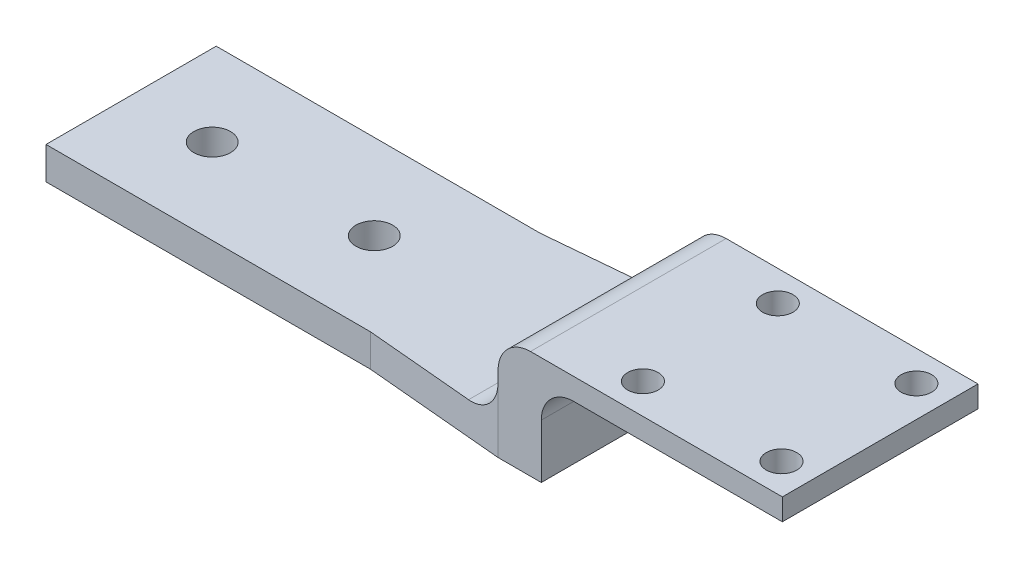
from build123d import *

# Parameters (mm, degrees)
BODY_DEPTH                           = 38.1
F_13_64_0_20313_DIAMETER_HOLE1_D     = 5.159502
F_13_64_0_20313_DIAMETER_HOLE1_DEPTH = 3.556
F_13_64_0_20313_DIAMETER_HOLE1_TIP   = 1.550070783
CHAMFER1_SIZE                        = 0.635
CHAMFER1_SIZE2                       = 0.366617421
REACHER_DEPTH                        = 3.81
SKETCH13_W                           = 5.08
SKETCH13_H                           = 22.987
BOSS_EXTRUDE4_DEPTH                  = 8.89
SKETCH11_R                           = 1.7907
BOSS_EXTRUDE3_DEPTH                  = 2.54
FILLET1_R                            = 3.81


with BuildPart() as part:
    # Profile → Body (new body)
    with BuildSketch(Plane(origin=(0, 0, 0), x_dir=(0, 0, -1), z_dir=(1, 0, 0))):
        Polygon((20, -1.905), (20, 1.905), (0, 1.905), (0, -1.905), (4.92, -1.905), (10, -1.905), (15.08, -1.905), align=None)
    extrude(amount=BODY_DEPTH)

    # 13_64 _0.20313_ Diameter Hole1
    with Locations(Plane(origin=(0, -1.905, 0), x_dir=(-1, 0, 0), z_dir=(0, -1, 0))):
        with Locations((-28.575, 10), (-9.525, 10)):
            Hole(F_13_64_0_20313_DIAMETER_HOLE1_D / 2, depth=F_13_64_0_20313_DIAMETER_HOLE1_DEPTH)
            with Locations((0, 0, -(F_13_64_0_20313_DIAMETER_HOLE1_DEPTH + F_13_64_0_20313_DIAMETER_HOLE1_TIP / 2))):  # 118° drill point
                Cone(0, F_13_64_0_20313_DIAMETER_HOLE1_D / 2, F_13_64_0_20313_DIAMETER_HOLE1_TIP, mode=Mode.SUBTRACT)

    # Chamfer1
    chamfer1_edges = [part.edges().sort_by_distance(p)[0] for p in [
        (6.945249, -1.905, -10),
        (25.995249, -1.905, -10),
    ]]
    chamfer1_side = [part.faces().sort_by_distance(p)[0] for p in [
        (19.05, -1.905, -10),
    ]]
    chamfer(chamfer1_edges, length=CHAMFER1_SIZE, length2=CHAMFER1_SIZE2, reference=chamfer1_side[0])

    # Sketch9 → Reacher (add)
    with BuildSketch(Plane(origin=(0, -1.905, 0), x_dir=(1, 0, 0), z_dir=(0, 1, 0))):
        Polygon((54.61, 21.4935), (38.1, 20), (38.1, 0), (54.61, -1.4935), (59.69, -1.4935), (59.69, 21.4935), align=None)
    extrude(amount=REACHER_DEPTH)

    # Sketch13 → Boss-Extrude4 (add)
    with BuildSketch(Plane(origin=(0, 1.905, 0), x_dir=(1, 0, 0), z_dir=(0, 1, 0))):
        with Locations((57.15, 10)):
            Rectangle(SKETCH13_W, SKETCH13_H)
    extrude(amount=BOSS_EXTRUDE4_DEPTH)

    # Sketch11 → Boss-Extrude3 (add)
    with BuildSketch(Plane(origin=(0, 10.795, 0), x_dir=(1, 0, 0), z_dir=(0, 1, 0))):
        Polygon((64.389, 21.4935), (59.69, 21.4935), (59.69, -1.4935), (64.389, -1.4935), (88.011, -1.4935), (88.011, 21.4935), align=None)
        with Locations(Location((68.056282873, 17.9248, 0), (0, 0, 270))):
            Circle(SKETCH11_R, mode=Mode.SUBTRACT)
        with Locations(Location((84.343717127, 17.9248, 0), (0, 0, 270))):
            Circle(SKETCH11_R, mode=Mode.SUBTRACT)
        with Locations(Location((84.343717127, 2.0752, 0), (0, 0, 270))):
            Circle(SKETCH11_R, mode=Mode.SUBTRACT)
        with Locations(Location((68.056282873, 2.0752, 0), (0, 0, 270))):
            Circle(SKETCH11_R, mode=Mode.SUBTRACT)
    extrude(amount=-BOSS_EXTRUDE3_DEPTH)

    # Fillet1
    fillet1_edges = [part.edges().sort_by_distance(p)[0] for p in [
        (54.61, 1.905, -10),
        (54.61, 10.795, -10),
        (59.69, 8.255, -10),
    ]]
    fillet(fillet1_edges, radius=FILLET1_R)


solid = part.part
